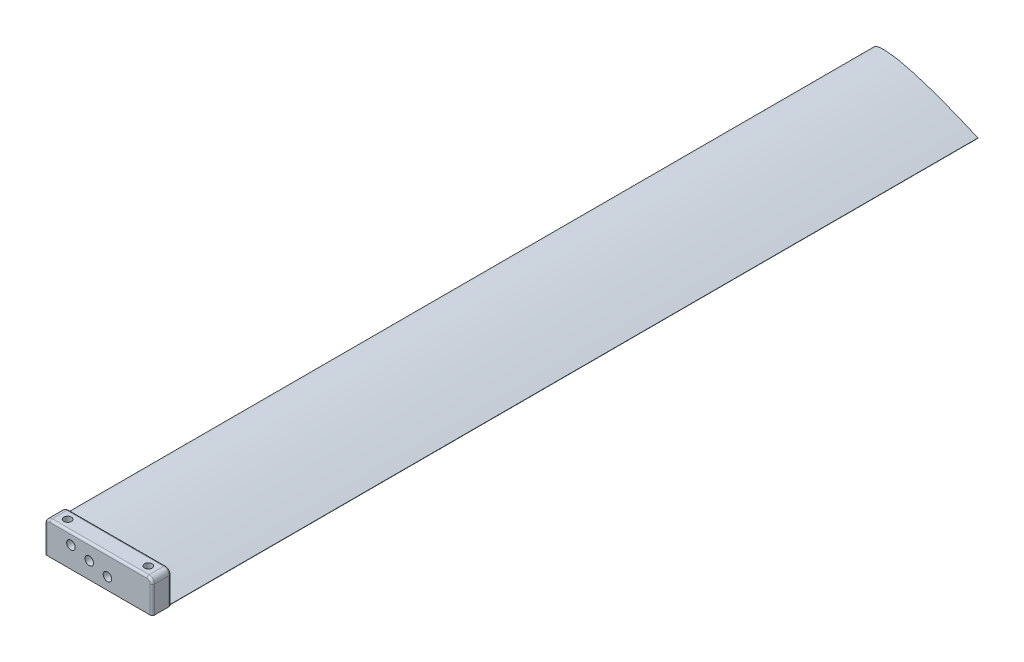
ISO-10303-21;
HEADER;
FILE_DESCRIPTION(('STEP AP214'),'2;1');
FILE_NAME('part.step','',(''),(''),'','','');
FILE_SCHEMA(('AUTOMOTIVE_DESIGN { 1 0 10303 214 1 1 1 1 }'));
ENDSEC;
DATA;
#1=APPLICATION_CONTEXT('core data for automotive mechanical design processes');
#2=APPLICATION_PROTOCOL_DEFINITION('international standard','automotive_design',2000,#1);
#3=PRODUCT_CONTEXT('',#1,'mechanical');
#4=PRODUCT('Part','Part','',(#3));
#5=PRODUCT_RELATED_PRODUCT_CATEGORY('part','',(#4));
#6=PRODUCT_DEFINITION_FORMATION('','',#4);
#7=PRODUCT_DEFINITION_CONTEXT('part definition',#1,'design');
#8=PRODUCT_DEFINITION('design','',#6,#7);
#9=PRODUCT_DEFINITION_SHAPE('','',#8);
#10=(LENGTH_UNIT() NAMED_UNIT(*) SI_UNIT(.MILLI.,.METRE.));
#11=(NAMED_UNIT(*) PLANE_ANGLE_UNIT() SI_UNIT($,.RADIAN.));
#12=(NAMED_UNIT(*) SI_UNIT($,.STERADIAN.) SOLID_ANGLE_UNIT());
#13=UNCERTAINTY_MEASURE_WITH_UNIT(LENGTH_MEASURE(1.E-05),#10,'distance_accuracy_value','');
#14=(GEOMETRIC_REPRESENTATION_CONTEXT(3) GLOBAL_UNCERTAINTY_ASSIGNED_CONTEXT((#13)) GLOBAL_UNIT_ASSIGNED_CONTEXT((#10,
#11,#12)) REPRESENTATION_CONTEXT('',''));
#15=CARTESIAN_POINT('',(0.,0.,0.));
#16=DIRECTION('',(0.,0.,1.));
#17=DIRECTION('',(1.,0.,0.));
#18=AXIS2_PLACEMENT_3D('',#15,#16,#17);
#19=CARTESIAN_POINT('',(6.13081109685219E-08,2.45893174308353E-07,0.));
#20=DIRECTION('',(0.,0.,-1.));
#21=DIRECTION('',(-1.,0.,0.));
#22=AXIS2_PLACEMENT_3D('',#19,#20,#21);
#23=PLANE('',#22);
#24=CARTESIAN_POINT('',(11.0904801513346,-2.76516726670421,0.));
#25=DIRECTION('',(0.,0.,-1.));
#26=DIRECTION('',(-1.,0.,0.));
#27=AXIS2_PLACEMENT_3D('',#24,#25,#26);
#28=CIRCLE('',#27,2.);
#29=CARTESIAN_POINT('',(9.09048015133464,-2.76516726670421,0.));
#30=VERTEX_POINT('',#29);
#31=EDGE_CURVE('E77',#30,#30,#28,.T.);
#32=ORIENTED_EDGE('',*,*,#31,.T.);
#33=EDGE_LOOP('',(#32));
#34=FACE_BOUND('',#33,.T.);
#35=CARTESIAN_POINT('',(19.7264687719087,-4.87509630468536,0.));
#36=DIRECTION('',(0.,0.,-1.));
#37=DIRECTION('',(-1.,0.,0.));
#38=AXIS2_PLACEMENT_3D('',#35,#36,#37);
#39=CIRCLE('',#38,2.00000000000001);
#40=CARTESIAN_POINT('',(17.7264687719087,-4.87509630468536,0.));
#41=VERTEX_POINT('',#40);
#42=EDGE_CURVE('E222',#41,#41,#39,.T.);
#43=ORIENTED_EDGE('',*,*,#42,.T.);
#44=EDGE_LOOP('',(#43));
#45=FACE_BOUND('',#44,.T.);
#46=CARTESIAN_POINT('',(28.3277194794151,-7.12244724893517,0.));
#47=DIRECTION('',(0.,0.,-1.));
#48=DIRECTION('',(-1.,0.,0.));
#49=AXIS2_PLACEMENT_3D('',#46,#47,#48);
#50=CIRCLE('',#49,2.);
#51=CARTESIAN_POINT('',(26.3277194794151,-7.12244724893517,0.));
#52=VERTEX_POINT('',#51);
#53=EDGE_CURVE('E215',#52,#52,#50,.T.);
#54=ORIENTED_EDGE('',*,*,#53,.T.);
#55=EDGE_LOOP('',(#54));
#56=FACE_BOUND('',#55,.T.);
#57=CARTESIAN_POINT('',(49.310441,-12.211752,0.));
#58=CARTESIAN_POINT('',(48.5244228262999,-11.8657049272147,0.));
#59=CARTESIAN_POINT('',(46.9535992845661,-11.174144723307,0.));
#60=CARTESIAN_POINT('',(43.8001058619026,-9.83033649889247,0.));
#61=CARTESIAN_POINT('',(39.8445837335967,-8.20403911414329,0.));
#62=CARTESIAN_POINT('',(35.0751396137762,-6.33296193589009,0.));
#63=CARTESIAN_POINT('',(30.2849545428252,-4.54710908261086,0.));
#64=CARTESIAN_POINT('',(25.4693502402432,-2.86297778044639,0.));
#65=CARTESIAN_POINT('',(20.620100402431,-1.31046332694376,0.));
#66=CARTESIAN_POINT('',(16.5368800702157,-0.171497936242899,0.));
#67=CARTESIAN_POINT('',(13.2377727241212,0.603440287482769,0.));
#68=CARTESIAN_POINT('',(10.7400649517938,1.09667848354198,0.));
#69=CARTESIAN_POINT('',(8.21087812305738,1.47806359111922,0.));
#70=CARTESIAN_POINT('',(6.07206028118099,1.66242657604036,0.));
#71=CARTESIAN_POINT('',(4.33195767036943,1.68140741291,0.));
#72=CARTESIAN_POINT('',(2.98703440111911,1.60069763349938,0.));
#73=CARTESIAN_POINT('',(1.81994498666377,1.38674481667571,0.));
#74=CARTESIAN_POINT('',(0.721860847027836,0.992369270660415,0.));
#75=CARTESIAN_POINT('',(-0.283483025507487,0.0706801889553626,0.));
#76=CARTESIAN_POINT('',(0.171475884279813,-1.21510315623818,0.));
#77=CARTESIAN_POINT('',(0.955878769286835,-2.07883507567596,0.));
#78=CARTESIAN_POINT('',(1.88591289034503,-2.81565928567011,0.));
#79=CARTESIAN_POINT('',(3.03551868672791,-3.51832584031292,0.));
#80=CARTESIAN_POINT('',(4.5808487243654,-4.31849594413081,0.));
#81=CARTESIAN_POINT('',(6.55586614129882,-5.15982667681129,0.));
#82=CARTESIAN_POINT('',(8.96805485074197,-6.01046482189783,0.));
#83=CARTESIAN_POINT('',(11.4049616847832,-6.74756371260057,0.));
#84=CARTESIAN_POINT('',(14.6817120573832,-7.61217067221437,0.));
#85=CARTESIAN_POINT('',(18.8216932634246,-8.52348088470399,0.));
#86=CARTESIAN_POINT('',(23.8321882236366,-9.42927632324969,0.));
#87=CARTESIAN_POINT('',(28.8747663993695,-10.2030649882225,0.));
#88=CARTESIAN_POINT('',(33.9426557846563,-10.8751074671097,0.));
#89=CARTESIAN_POINT('',(39.0322424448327,-11.4621609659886,0.));
#90=CARTESIAN_POINT('',(43.2882612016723,-11.883233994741,0.));
#91=CARTESIAN_POINT('',(46.7035103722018,-12.1771949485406,0.));
#92=CARTESIAN_POINT('',(48.4151330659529,-12.3040403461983,0.));
#93=CARTESIAN_POINT('',(49.271605,-12.367512,0.));
#94=B_SPLINE_CURVE_WITH_KNOTS('',3,(#57,#58,#59,#60,#61,#62,#63,#64,#65,#66,#67,#68,#69,#70,#71,
#72,#73,#74,#75,#76,#77,#78,#79,#80,#81,#82,#83,#84,#85,#86,#87,#88,#89,#90,#91,#92,#93),
.UNSPECIFIED.,.F.,.F.,(4,1,1,1,1,1,1,1,1,1,1,1,1,1,1,1,1,1,1,1,1,1,1,1,1,1,1,1,1,1,1,1,1,1,4),
(0.,0.0246840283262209,0.0493299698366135,0.0985220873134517,0.147602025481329,
0.196578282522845,0.245450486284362,0.294218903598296,0.342903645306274,0.367241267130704,
0.391607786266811,0.416059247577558,0.440726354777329,0.453242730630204,0.466028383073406,
0.479472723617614,0.486972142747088,0.500000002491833,0.513027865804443,0.52052727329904,
0.533971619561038,0.546757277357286,0.559273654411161,0.583940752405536,0.60839221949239,
0.632758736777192,0.657096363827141,0.70578110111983,0.754549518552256,0.803421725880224,
0.852397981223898,0.901477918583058,0.950670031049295,0.975315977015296,1.),.UNSPECIFIED.);
#95=CARTESIAN_POINT('',(49.310441,-12.211752,0.));
#96=VERTEX_POINT('',#95);
#97=CARTESIAN_POINT('',(49.271605,-12.367512,0.));
#98=VERTEX_POINT('',#97);
#99=EDGE_CURVE('E82',#96,#98,#94,.T.);
#100=ORIENTED_EDGE('',*,*,#99,.T.);
#101=CARTESIAN_POINT('',(49.291023,-12.289632,0.));
#102=DIRECTION('',(0.,0.,1.));
#103=DIRECTION('',(-1.,0.,0.));
#104=AXIS2_PLACEMENT_3D('',#101,#102,#103);
#105=CIRCLE('',#104,0.0802642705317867);
#106=EDGE_CURVE('E13',#98,#96,#105,.T.);
#107=ORIENTED_EDGE('',*,*,#106,.T.);
#108=EDGE_LOOP('',(#100,#107));
#109=FACE_BOUND('',#108,.T.);
#110=ADVANCED_FACE('F73',(#34,#45,#56,#109),#23,.F.);
#111=CARTESIAN_POINT('',(6.13081109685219E-08,2.45893174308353E-07,-381.));
#112=DIRECTION('',(0.,0.,-1.));
#113=DIRECTION('',(-1.,0.,0.));
#114=AXIS2_PLACEMENT_3D('',#111,#112,#113);
#115=PLANE('',#114);
#116=CARTESIAN_POINT('',(49.310441,-12.211752,-381.));
#117=CARTESIAN_POINT('',(48.5244228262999,-11.8657049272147,-381.));
#118=CARTESIAN_POINT('',(46.9535992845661,-11.174144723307,-381.));
#119=CARTESIAN_POINT('',(43.8001058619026,-9.83033649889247,-381.));
#120=CARTESIAN_POINT('',(39.8445837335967,-8.20403911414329,-381.));
#121=CARTESIAN_POINT('',(35.0751396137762,-6.33296193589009,-381.));
#122=CARTESIAN_POINT('',(30.2849545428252,-4.54710908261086,-381.));
#123=CARTESIAN_POINT('',(25.4693502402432,-2.86297778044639,-381.));
#124=CARTESIAN_POINT('',(20.620100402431,-1.31046332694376,-381.));
#125=CARTESIAN_POINT('',(16.5368800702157,-0.171497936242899,-381.));
#126=CARTESIAN_POINT('',(13.2377727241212,0.603440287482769,-381.));
#127=CARTESIAN_POINT('',(10.7400649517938,1.09667848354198,-381.));
#128=CARTESIAN_POINT('',(8.21087812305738,1.47806359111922,-381.));
#129=CARTESIAN_POINT('',(6.07206028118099,1.66242657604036,-381.));
#130=CARTESIAN_POINT('',(4.33195767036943,1.68140741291,-381.));
#131=CARTESIAN_POINT('',(2.98703440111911,1.60069763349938,-381.));
#132=CARTESIAN_POINT('',(1.81994498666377,1.38674481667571,-381.));
#133=CARTESIAN_POINT('',(0.721860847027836,0.992369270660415,-381.));
#134=CARTESIAN_POINT('',(-0.283483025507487,0.0706801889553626,-381.));
#135=CARTESIAN_POINT('',(0.171475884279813,-1.21510315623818,-381.));
#136=CARTESIAN_POINT('',(0.955878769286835,-2.07883507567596,-381.));
#137=CARTESIAN_POINT('',(1.88591289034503,-2.81565928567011,-381.));
#138=CARTESIAN_POINT('',(3.03551868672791,-3.51832584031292,-381.));
#139=CARTESIAN_POINT('',(4.5808487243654,-4.31849594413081,-381.));
#140=CARTESIAN_POINT('',(6.55586614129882,-5.15982667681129,-381.));
#141=CARTESIAN_POINT('',(8.96805485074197,-6.01046482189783,-381.));
#142=CARTESIAN_POINT('',(11.4049616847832,-6.74756371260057,-381.));
#143=CARTESIAN_POINT('',(14.6817120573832,-7.61217067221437,-381.));
#144=CARTESIAN_POINT('',(18.8216932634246,-8.52348088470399,-381.));
#145=CARTESIAN_POINT('',(23.8321882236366,-9.42927632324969,-381.));
#146=CARTESIAN_POINT('',(28.8747663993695,-10.2030649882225,-381.));
#147=CARTESIAN_POINT('',(33.9426557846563,-10.8751074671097,-381.));
#148=CARTESIAN_POINT('',(39.0322424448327,-11.4621609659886,-381.));
#149=CARTESIAN_POINT('',(43.2882612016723,-11.883233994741,-381.));
#150=CARTESIAN_POINT('',(46.7035103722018,-12.1771949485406,-381.));
#151=CARTESIAN_POINT('',(48.4151330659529,-12.3040403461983,-381.));
#152=CARTESIAN_POINT('',(49.271605,-12.367512,-381.));
#153=B_SPLINE_CURVE_WITH_KNOTS('',3,(#116,#117,#118,#119,#120,#121,#122,#123,#124,#125,#126,
#127,#128,#129,#130,#131,#132,#133,#134,#135,#136,#137,#138,#139,#140,#141,#142,#143,#144,#145,
#146,#147,#148,#149,#150,#151,#152),.UNSPECIFIED.,.F.,.F.,(4,1,1,1,1,1,1,1,1,1,1,1,1,1,1,1,1,1,
1,1,1,1,1,1,1,1,1,1,1,1,1,1,1,1,4),(0.,0.0246840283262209,0.0493299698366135,0.0985220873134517,
0.147602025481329,0.196578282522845,0.245450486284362,0.294218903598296,0.342903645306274,
0.367241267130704,0.391607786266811,0.416059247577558,0.440726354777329,0.453242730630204,
0.466028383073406,0.479472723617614,0.486972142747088,0.500000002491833,0.513027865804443,
0.52052727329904,0.533971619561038,0.546757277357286,0.559273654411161,0.583940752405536,
0.60839221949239,0.632758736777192,0.657096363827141,0.70578110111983,0.754549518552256,
0.803421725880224,0.852397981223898,0.901477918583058,0.950670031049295,0.975315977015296,1.),.UNSPECIFIED.);
#154=CARTESIAN_POINT('',(49.310441,-12.211752,-381.));
#155=VERTEX_POINT('',#154);
#156=CARTESIAN_POINT('',(49.271605,-12.367512,-381.));
#157=VERTEX_POINT('',#156);
#158=EDGE_CURVE('E106',#155,#157,#153,.T.);
#159=ORIENTED_EDGE('',*,*,#158,.F.);
#160=CARTESIAN_POINT('',(48.9107991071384,-12.194829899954,-381.));
#161=DIRECTION('',(0.,0.,1.));
#162=DIRECTION('',(-1.,0.,0.));
#163=AXIS2_PLACEMENT_3D('',#160,#161,#162);
#164=CIRCLE('',#163,0.399999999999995);
#165=EDGE_CURVE('E110',#157,#155,#164,.T.);
#166=ORIENTED_EDGE('',*,*,#165,.F.);
#167=EDGE_LOOP('',(#159,#166));
#168=FACE_BOUND('',#167,.T.);
#169=ADVANCED_FACE('F120',(#168),#115,.T.);
#170=CARTESIAN_POINT('',(49.310441,-12.211752,-381.));
#171=CARTESIAN_POINT('',(49.310441,-12.211752,0.));
#172=CARTESIAN_POINT('',(48.5244228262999,-11.8657049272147,-381.));
#173=CARTESIAN_POINT('',(48.5244228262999,-11.8657049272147,0.));
#174=CARTESIAN_POINT('',(46.9535992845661,-11.174144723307,-381.));
#175=CARTESIAN_POINT('',(46.9535992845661,-11.174144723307,0.));
#176=CARTESIAN_POINT('',(43.8001058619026,-9.83033649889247,-381.));
#177=CARTESIAN_POINT('',(43.8001058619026,-9.83033649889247,0.));
#178=CARTESIAN_POINT('',(39.8445837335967,-8.20403911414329,-381.));
#179=CARTESIAN_POINT('',(39.8445837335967,-8.20403911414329,0.));
#180=CARTESIAN_POINT('',(35.0751396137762,-6.33296193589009,-381.));
#181=CARTESIAN_POINT('',(35.0751396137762,-6.33296193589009,0.));
#182=CARTESIAN_POINT('',(30.2849545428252,-4.54710908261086,-381.));
#183=CARTESIAN_POINT('',(30.2849545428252,-4.54710908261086,0.));
#184=CARTESIAN_POINT('',(25.4693502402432,-2.86297778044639,-381.));
#185=CARTESIAN_POINT('',(25.4693502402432,-2.86297778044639,0.));
#186=CARTESIAN_POINT('',(20.620100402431,-1.31046332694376,-381.));
#187=CARTESIAN_POINT('',(20.620100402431,-1.31046332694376,0.));
#188=CARTESIAN_POINT('',(16.5368800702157,-0.171497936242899,-381.));
#189=CARTESIAN_POINT('',(16.5368800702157,-0.171497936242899,0.));
#190=CARTESIAN_POINT('',(13.2377727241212,0.603440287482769,-381.));
#191=CARTESIAN_POINT('',(13.2377727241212,0.603440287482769,0.));
#192=CARTESIAN_POINT('',(10.7400649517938,1.09667848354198,-381.));
#193=CARTESIAN_POINT('',(10.7400649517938,1.09667848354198,0.));
#194=CARTESIAN_POINT('',(8.21087812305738,1.47806359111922,-381.));
#195=CARTESIAN_POINT('',(8.21087812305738,1.47806359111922,0.));
#196=CARTESIAN_POINT('',(6.07206028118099,1.66242657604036,-381.));
#197=CARTESIAN_POINT('',(6.07206028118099,1.66242657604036,0.));
#198=CARTESIAN_POINT('',(4.33195767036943,1.68140741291,-381.));
#199=CARTESIAN_POINT('',(4.33195767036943,1.68140741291,0.));
#200=CARTESIAN_POINT('',(2.98703440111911,1.60069763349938,-381.));
#201=CARTESIAN_POINT('',(2.98703440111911,1.60069763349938,0.));
#202=CARTESIAN_POINT('',(1.81994498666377,1.38674481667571,-381.));
#203=CARTESIAN_POINT('',(1.81994498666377,1.38674481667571,0.));
#204=CARTESIAN_POINT('',(0.721860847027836,0.992369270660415,-381.));
#205=CARTESIAN_POINT('',(0.721860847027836,0.992369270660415,0.));
#206=CARTESIAN_POINT('',(-0.283483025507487,0.0706801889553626,-381.));
#207=CARTESIAN_POINT('',(-0.283483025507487,0.0706801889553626,0.));
#208=CARTESIAN_POINT('',(0.171475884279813,-1.21510315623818,-381.));
#209=CARTESIAN_POINT('',(0.171475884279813,-1.21510315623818,0.));
#210=CARTESIAN_POINT('',(0.955878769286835,-2.07883507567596,-381.));
#211=CARTESIAN_POINT('',(0.955878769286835,-2.07883507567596,0.));
#212=CARTESIAN_POINT('',(1.88591289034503,-2.81565928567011,-381.));
#213=CARTESIAN_POINT('',(1.88591289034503,-2.81565928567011,0.));
#214=CARTESIAN_POINT('',(3.03551868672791,-3.51832584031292,-381.));
#215=CARTESIAN_POINT('',(3.03551868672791,-3.51832584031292,0.));
#216=CARTESIAN_POINT('',(4.5808487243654,-4.31849594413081,-381.));
#217=CARTESIAN_POINT('',(4.5808487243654,-4.31849594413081,0.));
#218=CARTESIAN_POINT('',(6.55586614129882,-5.15982667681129,-381.));
#219=CARTESIAN_POINT('',(6.55586614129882,-5.15982667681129,0.));
#220=CARTESIAN_POINT('',(8.96805485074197,-6.01046482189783,-381.));
#221=CARTESIAN_POINT('',(8.96805485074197,-6.01046482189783,0.));
#222=CARTESIAN_POINT('',(11.4049616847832,-6.74756371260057,-381.));
#223=CARTESIAN_POINT('',(11.4049616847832,-6.74756371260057,0.));
#224=CARTESIAN_POINT('',(14.6817120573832,-7.61217067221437,-381.));
#225=CARTESIAN_POINT('',(14.6817120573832,-7.61217067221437,0.));
#226=CARTESIAN_POINT('',(18.8216932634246,-8.52348088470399,-381.));
#227=CARTESIAN_POINT('',(18.8216932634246,-8.52348088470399,0.));
#228=CARTESIAN_POINT('',(23.8321882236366,-9.42927632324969,-381.));
#229=CARTESIAN_POINT('',(23.8321882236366,-9.42927632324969,0.));
#230=CARTESIAN_POINT('',(28.8747663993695,-10.2030649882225,-381.));
#231=CARTESIAN_POINT('',(28.8747663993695,-10.2030649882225,0.));
#232=CARTESIAN_POINT('',(33.9426557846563,-10.8751074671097,-381.));
#233=CARTESIAN_POINT('',(33.9426557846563,-10.8751074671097,0.));
#234=CARTESIAN_POINT('',(39.0322424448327,-11.4621609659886,-381.));
#235=CARTESIAN_POINT('',(39.0322424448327,-11.4621609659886,0.));
#236=CARTESIAN_POINT('',(43.2882612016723,-11.883233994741,-381.));
#237=CARTESIAN_POINT('',(43.2882612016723,-11.883233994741,0.));
#238=CARTESIAN_POINT('',(46.7035103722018,-12.1771949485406,-381.));
#239=CARTESIAN_POINT('',(46.7035103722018,-12.1771949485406,0.));
#240=CARTESIAN_POINT('',(48.4151330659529,-12.3040403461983,-381.));
#241=CARTESIAN_POINT('',(48.4151330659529,-12.3040403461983,0.));
#242=CARTESIAN_POINT('',(49.271605,-12.367512,-381.));
#243=CARTESIAN_POINT('',(49.271605,-12.367512,0.));
#244=B_SPLINE_SURFACE_WITH_KNOTS('',3,1,((#170,#171),(#172,#173),(#174,#175),(#176,#177),(#178,
#179),(#180,#181),(#182,#183),(#184,#185),(#186,#187),(#188,#189),(#190,#191),(#192,#193),(#194,
#195),(#196,#197),(#198,#199),(#200,#201),(#202,#203),(#204,#205),(#206,#207),(#208,#209),(#210,
#211),(#212,#213),(#214,#215),(#216,#217),(#218,#219),(#220,#221),(#222,#223),(#224,#225),(#226,
#227),(#228,#229),(#230,#231),(#232,#233),(#234,#235),(#236,#237),(#238,#239),(#240,#241),(#242,
#243)),.UNSPECIFIED.,.F.,.F.,.F.,(4,1,1,1,1,1,1,1,1,1,1,1,1,1,1,1,1,1,1,1,1,1,1,1,1,1,1,1,1,1,1,
1,1,1,4),(2,2),(0.,0.0246840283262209,0.0493299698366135,0.0985220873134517,0.147602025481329,
0.196578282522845,0.245450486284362,0.294218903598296,0.342903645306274,0.367241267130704,
0.391607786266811,0.416059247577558,0.440726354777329,0.453242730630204,0.466028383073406,
0.479472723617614,0.486972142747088,0.500000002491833,0.513027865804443,0.52052727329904,
0.533971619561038,0.546757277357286,0.559273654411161,0.583940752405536,0.60839221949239,
0.632758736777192,0.657096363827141,0.70578110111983,0.754549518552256,0.803421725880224,
0.852397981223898,0.901477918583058,0.950670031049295,0.975315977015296,1.),(0.,1.),.UNSPECIFIED.);
#245=DIRECTION('',(0.,0.,1.));
#246=VECTOR('',#245,1.);
#247=CARTESIAN_POINT('',(49.271605,-12.367512,-190.5));
#248=LINE('',#247,#246);
#249=EDGE_CURVE('E90',#157,#98,#248,.T.);
#250=DIRECTION('',(0.,0.,-1.));
#251=VECTOR('',#250,1.);
#252=CARTESIAN_POINT('',(49.310441,-12.211752,-190.5));
#253=LINE('',#252,#251);
#254=EDGE_CURVE('E102',#96,#155,#253,.T.);
#255=ORIENTED_EDGE('',*,*,#158,.T.);
#256=ORIENTED_EDGE('',*,*,#249,.T.);
#257=ORIENTED_EDGE('',*,*,#99,.F.);
#258=ORIENTED_EDGE('',*,*,#254,.T.);
#259=EDGE_LOOP('',(#255,#256,#257,#258));
#260=FACE_BOUND('',#259,.T.);
#261=ADVANCED_FACE('F104',(#260),#244,.T.);
#262=CARTESIAN_POINT('',(49.271605,-12.367512,-381.));
#263=CARTESIAN_POINT('',(49.271605,-12.367512,0.));
#264=CARTESIAN_POINT('',(49.2773800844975,-12.3554454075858,-381.));
#265=CARTESIAN_POINT('',(49.284585,-12.3707483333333,0.));
#266=CARTESIAN_POINT('',(49.2825533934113,-12.3430184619,-381.));
#267=CARTESIAN_POINT('',(49.30249532,-12.3719050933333,0.));
#268=CARTESIAN_POINT('',(49.2916470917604,-12.3176418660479,-381.));
#269=CARTESIAN_POINT('',(49.34193788,-12.3552685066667,0.));
#270=CARTESIAN_POINT('',(49.2955674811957,-12.3046922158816,-381.));
#271=CARTESIAN_POINT('',(49.3624303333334,-12.33501,0.));
#272=CARTESIAN_POINT('',(49.3021059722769,-12.2784682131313,-381.));
#273=CARTESIAN_POINT('',(49.3753756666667,-12.28309,0.));
#274=CARTESIAN_POINT('',(49.3047240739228,-12.2651938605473,-381.));
#275=CARTESIAN_POINT('',(49.36679292,-12.2555821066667,0.));
#276=CARTESIAN_POINT('',(49.3086086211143,-12.2385184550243,-381.));
#277=CARTESIAN_POINT('',(49.33977788,-12.2223754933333,0.));
#278=CARTESIAN_POINT('',(49.30987506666,-12.2251174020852,-381.));
#279=CARTESIAN_POINT('',(49.323421,-12.2149883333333,0.));
#280=CARTESIAN_POINT('',(49.310441,-12.211752,-381.));
#281=CARTESIAN_POINT('',(49.310441,-12.211752,0.));
#282=B_SPLINE_SURFACE_WITH_KNOTS('',3,1,((#262,#263),(#264,#265),(#266,#267),(#268,#269),(#270,
#271),(#272,#273),(#274,#275),(#276,#277),(#278,#279),(#280,#281)),.UNSPECIFIED.,.F.,.F.,.F.,(4,
2,2,2,4),(2,2),(0.,0.25,0.5,0.75,1.),(0.,1.),.UNSPECIFIED.);
#283=ORIENTED_EDGE('',*,*,#165,.T.);
#284=ORIENTED_EDGE('',*,*,#254,.F.);
#285=ORIENTED_EDGE('',*,*,#106,.F.);
#286=ORIENTED_EDGE('',*,*,#249,.F.);
#287=EDGE_LOOP('',(#283,#284,#285,#286));
#288=FACE_BOUND('',#287,.T.);
#289=ADVANCED_FACE('F113',(#288),#282,.T.);
#290=CARTESIAN_POINT('',(28.3277194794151,-7.12244724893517,-35.56));
#291=DIRECTION('',(0.,0.,1.));
#292=DIRECTION('',(1.,0.,0.));
#293=AXIS2_PLACEMENT_3D('',#290,#291,#292);
#294=CYLINDRICAL_SURFACE('',#293,2.);
#295=CARTESIAN_POINT('',(28.3277194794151,-7.12244724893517,-35.56));
#296=DIRECTION('',(0.,0.,1.));
#297=DIRECTION('',(1.,0.,0.));
#298=AXIS2_PLACEMENT_3D('',#295,#296,#297);
#299=CIRCLE('',#298,2.);
#300=CARTESIAN_POINT('',(30.3277194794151,-7.12244724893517,-35.56));
#301=VERTEX_POINT('',#300);
#302=EDGE_CURVE('E338',#301,#301,#299,.T.);
#303=ORIENTED_EDGE('',*,*,#302,.F.);
#304=EDGE_LOOP('',(#303));
#305=FACE_BOUND('',#304,.T.);
#306=ORIENTED_EDGE('',*,*,#53,.F.);
#307=EDGE_LOOP('',(#306));
#308=FACE_BOUND('',#307,.T.);
#309=ADVANCED_FACE('F182',(#305,#308),#294,.F.);
#310=CARTESIAN_POINT('',(28.3277194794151,-7.12244724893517,-35.56));
#311=DIRECTION('',(0.,0.,1.));
#312=DIRECTION('',(1.,0.,0.));
#313=AXIS2_PLACEMENT_3D('',#310,#311,#312);
#314=PLANE('',#313);
#315=ORIENTED_EDGE('',*,*,#302,.T.);
#316=EDGE_LOOP('',(#315));
#317=FACE_BOUND('',#316,.T.);
#318=ADVANCED_FACE('F139',(#317),#314,.T.);
#319=CARTESIAN_POINT('',(19.7264687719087,-4.87509630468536,-35.56));
#320=DIRECTION('',(0.,0.,1.));
#321=DIRECTION('',(1.,0.,0.));
#322=AXIS2_PLACEMENT_3D('',#319,#320,#321);
#323=CYLINDRICAL_SURFACE('',#322,2.00000000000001);
#324=CARTESIAN_POINT('',(19.7264687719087,-4.87509630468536,-35.56));
#325=DIRECTION('',(0.,0.,1.));
#326=DIRECTION('',(1.,0.,0.));
#327=AXIS2_PLACEMENT_3D('',#324,#325,#326);
#328=CIRCLE('',#327,2.00000000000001);
#329=CARTESIAN_POINT('',(21.7264687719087,-4.87509630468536,-35.56));
#330=VERTEX_POINT('',#329);
#331=EDGE_CURVE('E337',#330,#330,#328,.T.);
#332=ORIENTED_EDGE('',*,*,#331,.F.);
#333=EDGE_LOOP('',(#332));
#334=FACE_BOUND('',#333,.T.);
#335=ORIENTED_EDGE('',*,*,#42,.F.);
#336=EDGE_LOOP('',(#335));
#337=FACE_BOUND('',#336,.T.);
#338=ADVANCED_FACE('F243',(#334,#337),#323,.F.);
#339=CARTESIAN_POINT('',(19.7264687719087,-4.87509630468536,-35.56));
#340=DIRECTION('',(0.,0.,1.));
#341=DIRECTION('',(1.,0.,0.));
#342=AXIS2_PLACEMENT_3D('',#339,#340,#341);
#343=PLANE('',#342);
#344=ORIENTED_EDGE('',*,*,#331,.T.);
#345=EDGE_LOOP('',(#344));
#346=FACE_BOUND('',#345,.T.);
#347=ADVANCED_FACE('F234',(#346),#343,.T.);
#348=CARTESIAN_POINT('',(11.0904801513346,-2.76516726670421,-35.56));
#349=DIRECTION('',(0.,0.,1.));
#350=DIRECTION('',(1.,0.,0.));
#351=AXIS2_PLACEMENT_3D('',#348,#349,#350);
#352=CYLINDRICAL_SURFACE('',#351,2.);
#353=CARTESIAN_POINT('',(11.0904801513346,-2.76516726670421,-35.56));
#354=DIRECTION('',(0.,0.,1.));
#355=DIRECTION('',(1.,0.,0.));
#356=AXIS2_PLACEMENT_3D('',#353,#354,#355);
#357=CIRCLE('',#356,2.);
#358=CARTESIAN_POINT('',(13.0904801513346,-2.76516726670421,-35.56));
#359=VERTEX_POINT('',#358);
#360=EDGE_CURVE('E223',#359,#359,#357,.T.);
#361=ORIENTED_EDGE('',*,*,#360,.F.);
#362=EDGE_LOOP('',(#361));
#363=FACE_BOUND('',#362,.T.);
#364=ORIENTED_EDGE('',*,*,#31,.F.);
#365=EDGE_LOOP('',(#364));
#366=FACE_BOUND('',#365,.T.);
#367=ADVANCED_FACE('F231',(#363,#366),#352,.F.);
#368=CARTESIAN_POINT('',(11.0904801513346,-2.76516726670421,-35.56));
#369=DIRECTION('',(0.,0.,1.));
#370=DIRECTION('',(1.,0.,0.));
#371=AXIS2_PLACEMENT_3D('',#368,#369,#370);
#372=PLANE('',#371);
#373=ORIENTED_EDGE('',*,*,#360,.T.);
#374=EDGE_LOOP('',(#373));
#375=FACE_BOUND('',#374,.T.);
#376=ADVANCED_FACE('F233',(#375),#372,.T.);
#377=CLOSED_SHELL('',(#110,#169,#261,#289,#309,#318,#338,#347,#367,#376));
#378=MANIFOLD_SOLID_BREP('B2',#377);
#379=CARTESIAN_POINT('',(-1.27,2.54,8.89));
#380=DIRECTION('',(1.,0.,0.));
#381=DIRECTION('',(0.,1.,0.));
#382=AXIS2_PLACEMENT_3D('',#379,#380,#381);
#383=PLANE('',#382);
#384=DIRECTION('',(0.,0.,-1.));
#385=VECTOR('',#384,1.);
#386=CARTESIAN_POINT('',(-1.27,0.,0.));
#387=LINE('',#386,#385);
#388=CARTESIAN_POINT('',(-1.27,0.,7.874));
#389=VERTEX_POINT('',#388);
#390=CARTESIAN_POINT('',(-1.27,0.,1.016));
#391=VERTEX_POINT('',#390);
#392=EDGE_CURVE('E465',#389,#391,#387,.T.);
#393=ORIENTED_EDGE('',*,*,#392,.T.);
#394=DIRECTION('',(0.,-1.,0.));
#395=VECTOR('',#394,1.);
#396=CARTESIAN_POINT('',(-1.27,2.54,1.016));
#397=LINE('',#396,#395);
#398=CARTESIAN_POINT('',(-1.27,-12.7,1.016));
#399=VERTEX_POINT('',#398);
#400=EDGE_CURVE('E471',#391,#399,#397,.T.);
#401=ORIENTED_EDGE('',*,*,#400,.T.);
#402=DIRECTION('',(0.,0.,-1.));
#403=VECTOR('',#402,1.);
#404=CARTESIAN_POINT('',(-1.27,-12.7,8.89));
#405=LINE('',#404,#403);
#406=CARTESIAN_POINT('',(-1.27,-12.7,7.874));
#407=VERTEX_POINT('',#406);
#408=EDGE_CURVE('E468',#407,#399,#405,.T.);
#409=ORIENTED_EDGE('',*,*,#408,.F.);
#410=DIRECTION('',(0.,-1.,0.));
#411=VECTOR('',#410,1.);
#412=CARTESIAN_POINT('',(-1.27,0.,7.874));
#413=LINE('',#412,#411);
#414=EDGE_CURVE('E462',#407,#389,#413,.F.);
#415=ORIENTED_EDGE('',*,*,#414,.T.);
#416=EDGE_LOOP('',(#393,#401,#409,#415));
#417=FACE_BOUND('',#416,.T.);
#418=ADVANCED_FACE('F371',(#417),#383,.F.);
#419=CARTESIAN_POINT('',(-1.27,-12.7,8.89));
#420=DIRECTION('',(0.,1.,0.));
#421=DIRECTION('',(0.,0.,1.));
#422=AXIS2_PLACEMENT_3D('',#419,#420,#421);
#423=PLANE('',#422);
#424=CARTESIAN_POINT('',(43.18,-12.7,4.445));
#425=DIRECTION('',(0.,1.,0.));
#426=DIRECTION('',(0.,0.,1.));
#427=AXIS2_PLACEMENT_3D('',#424,#425,#426);
#428=CIRCLE('',#427,1.7907);
#429=CARTESIAN_POINT('',(43.18,-12.7,6.2357));
#430=VERTEX_POINT('',#429);
#431=EDGE_CURVE('E541',#430,#430,#428,.T.);
#432=ORIENTED_EDGE('',*,*,#431,.T.);
#433=EDGE_LOOP('',(#432));
#434=FACE_BOUND('',#433,.T.);
#435=CARTESIAN_POINT('',(5.08,-12.7,4.445));
#436=DIRECTION('',(0.,1.,0.));
#437=DIRECTION('',(0.,0.,1.));
#438=AXIS2_PLACEMENT_3D('',#435,#436,#437);
#439=CIRCLE('',#438,1.7907);
#440=CARTESIAN_POINT('',(5.08,-12.7,6.2357));
#441=VERTEX_POINT('',#440);
#442=EDGE_CURVE('E548',#441,#441,#439,.T.);
#443=ORIENTED_EDGE('',*,*,#442,.T.);
#444=EDGE_LOOP('',(#443));
#445=FACE_BOUND('',#444,.T.);
#446=ORIENTED_EDGE('',*,*,#408,.T.);
#447=CARTESIAN_POINT('',(-0.253999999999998,-12.7,1.016));
#448=DIRECTION('',(0.,1.,0.));
#449=DIRECTION('',(0.,0.,1.));
#450=AXIS2_PLACEMENT_3D('',#447,#448,#449);
#451=CIRCLE('',#450,1.016);
#452=CARTESIAN_POINT('',(-0.253999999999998,-12.7,0.));
#453=VERTEX_POINT('',#452);
#454=EDGE_CURVE('E585',#399,#453,#451,.F.);
#455=ORIENTED_EDGE('',*,*,#454,.T.);
#456=DIRECTION('',(1.,0.,0.));
#457=VECTOR('',#456,1.);
#458=CARTESIAN_POINT('',(-1.27,-12.7,0.));
#459=LINE('',#458,#457);
#460=CARTESIAN_POINT('',(48.514,-12.7,0.));
#461=VERTEX_POINT('',#460);
#462=EDGE_CURVE('E544',#453,#461,#459,.T.);
#463=ORIENTED_EDGE('',*,*,#462,.T.);
#464=CARTESIAN_POINT('',(48.514,-12.7,1.016));
#465=DIRECTION('',(0.,1.,0.));
#466=DIRECTION('',(0.,0.,1.));
#467=AXIS2_PLACEMENT_3D('',#464,#465,#466);
#468=CIRCLE('',#467,1.016);
#469=CARTESIAN_POINT('',(49.53,-12.7,1.016));
#470=VERTEX_POINT('',#469);
#471=EDGE_CURVE('E581',#461,#470,#468,.F.);
#472=ORIENTED_EDGE('',*,*,#471,.T.);
#473=DIRECTION('',(0.,0.,-1.));
#474=VECTOR('',#473,1.);
#475=CARTESIAN_POINT('',(49.53,-12.7,8.89));
#476=LINE('',#475,#474);
#477=CARTESIAN_POINT('',(49.53,-12.7,7.874));
#478=VERTEX_POINT('',#477);
#479=EDGE_CURVE('E558',#478,#470,#476,.T.);
#480=ORIENTED_EDGE('',*,*,#479,.F.);
#481=CARTESIAN_POINT('',(48.514,-12.7,7.874));
#482=DIRECTION('',(0.,1.,0.));
#483=DIRECTION('',(0.,0.,1.));
#484=AXIS2_PLACEMENT_3D('',#481,#482,#483);
#485=CIRCLE('',#484,1.016);
#486=CARTESIAN_POINT('',(48.514,-12.7,8.89));
#487=VERTEX_POINT('',#486);
#488=EDGE_CURVE('E579',#478,#487,#485,.F.);
#489=ORIENTED_EDGE('',*,*,#488,.T.);
#490=DIRECTION('',(1.,0.,0.));
#491=VECTOR('',#490,1.);
#492=CARTESIAN_POINT('',(-1.27,-12.7,8.89));
#493=LINE('',#492,#491);
#494=CARTESIAN_POINT('',(-0.253999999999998,-12.7,8.89));
#495=VERTEX_POINT('',#494);
#496=EDGE_CURVE('E555',#495,#487,#493,.T.);
#497=ORIENTED_EDGE('',*,*,#496,.F.);
#498=CARTESIAN_POINT('',(-0.253999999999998,-12.7,7.874));
#499=DIRECTION('',(0.,1.,0.));
#500=DIRECTION('',(0.,0.,1.));
#501=AXIS2_PLACEMENT_3D('',#498,#499,#500);
#502=CIRCLE('',#501,1.016);
#503=EDGE_CURVE('E583',#495,#407,#502,.F.);
#504=ORIENTED_EDGE('',*,*,#503,.T.);
#505=EDGE_LOOP('',(#446,#455,#463,#472,#480,#489,#497,#504));
#506=FACE_BOUND('',#505,.T.);
#507=ADVANCED_FACE('F620',(#434,#445,#506),#423,.F.);
#508=CARTESIAN_POINT('',(49.53,2.54,8.89));
#509=DIRECTION('',(1.,0.,0.));
#510=DIRECTION('',(0.,0.,-1.));
#511=AXIS2_PLACEMENT_3D('',#508,#509,#510);
#512=PLANE('',#511);
#513=ORIENTED_EDGE('',*,*,#479,.T.);
#514=DIRECTION('',(0.,-1.,0.));
#515=VECTOR('',#514,1.);
#516=CARTESIAN_POINT('',(49.53,0.,1.016));
#517=LINE('',#516,#515);
#518=CARTESIAN_POINT('',(49.53,0.,1.016));
#519=VERTEX_POINT('',#518);
#520=EDGE_CURVE('E71',#470,#519,#517,.F.);
#521=ORIENTED_EDGE('',*,*,#520,.T.);
#522=DIRECTION('',(0.,0.,-1.));
#523=VECTOR('',#522,1.);
#524=CARTESIAN_POINT('',(49.53,0.,8.89));
#525=LINE('',#524,#523);
#526=CARTESIAN_POINT('',(49.53,0.,7.874));
#527=VERTEX_POINT('',#526);
#528=EDGE_CURVE('E472',#519,#527,#525,.F.);
#529=ORIENTED_EDGE('',*,*,#528,.T.);
#530=DIRECTION('',(0.,-1.,0.));
#531=VECTOR('',#530,1.);
#532=CARTESIAN_POINT('',(49.53,2.54,7.874));
#533=LINE('',#532,#531);
#534=EDGE_CURVE('E380',#527,#478,#533,.T.);
#535=ORIENTED_EDGE('',*,*,#534,.T.);
#536=EDGE_LOOP('',(#513,#521,#529,#535));
#537=FACE_BOUND('',#536,.T.);
#538=ADVANCED_FACE('F614',(#537),#512,.T.);
#539=CARTESIAN_POINT('',(-1.27,2.54,8.89));
#540=DIRECTION('',(0.,1.,0.));
#541=DIRECTION('',(0.,0.,1.));
#542=AXIS2_PLACEMENT_3D('',#539,#540,#541);
#543=PLANE('',#542);
#544=CARTESIAN_POINT('',(43.18,2.54,4.445));
#545=DIRECTION('',(0.,1.,0.));
#546=DIRECTION('',(0.,0.,1.));
#547=AXIS2_PLACEMENT_3D('',#544,#545,#546);
#548=CIRCLE('',#547,1.7907);
#549=CARTESIAN_POINT('',(43.18,2.54,6.2357));
#550=VERTEX_POINT('',#549);
#551=EDGE_CURVE('E545',#550,#550,#548,.T.);
#552=ORIENTED_EDGE('',*,*,#551,.F.);
#553=EDGE_LOOP('',(#552));
#554=FACE_BOUND('',#553,.T.);
#555=CARTESIAN_POINT('',(5.08,2.54,4.445));
#556=DIRECTION('',(0.,1.,0.));
#557=DIRECTION('',(0.,0.,1.));
#558=AXIS2_PLACEMENT_3D('',#555,#556,#557);
#559=CIRCLE('',#558,1.7907);
#560=CARTESIAN_POINT('',(5.08,2.54,6.2357));
#561=VERTEX_POINT('',#560);
#562=EDGE_CURVE('E551',#561,#561,#559,.T.);
#563=ORIENTED_EDGE('',*,*,#562,.F.);
#564=EDGE_LOOP('',(#563));
#565=FACE_BOUND('',#564,.T.);
#566=DIRECTION('',(0.,0.,-1.));
#567=VECTOR('',#566,1.);
#568=CARTESIAN_POINT('',(46.99,2.54,8.89));
#569=LINE('',#568,#567);
#570=CARTESIAN_POINT('',(46.99,2.54,7.874));
#571=VERTEX_POINT('',#570);
#572=CARTESIAN_POINT('',(46.99,2.54,1.016));
#573=VERTEX_POINT('',#572);
#574=EDGE_CURVE('E482',#571,#573,#569,.T.);
#575=ORIENTED_EDGE('',*,*,#574,.T.);
#576=DIRECTION('',(1.,0.,0.));
#577=VECTOR('',#576,1.);
#578=CARTESIAN_POINT('',(1.27,2.54,1.016));
#579=LINE('',#578,#577);
#580=CARTESIAN_POINT('',(1.27,2.54,1.016));
#581=VERTEX_POINT('',#580);
#582=EDGE_CURVE('E599',#573,#581,#579,.F.);
#583=ORIENTED_EDGE('',*,*,#582,.T.);
#584=DIRECTION('',(0.,0.,-1.));
#585=VECTOR('',#584,1.);
#586=CARTESIAN_POINT('',(1.27,2.54,8.89));
#587=LINE('',#586,#585);
#588=CARTESIAN_POINT('',(1.27,2.54,7.874));
#589=VERTEX_POINT('',#588);
#590=EDGE_CURVE('E574',#581,#589,#587,.F.);
#591=ORIENTED_EDGE('',*,*,#590,.T.);
#592=DIRECTION('',(1.,0.,0.));
#593=VECTOR('',#592,1.);
#594=CARTESIAN_POINT('',(-1.27,2.54,7.874));
#595=LINE('',#594,#593);
#596=EDGE_CURVE('E597',#589,#571,#595,.T.);
#597=ORIENTED_EDGE('',*,*,#596,.T.);
#598=EDGE_LOOP('',(#575,#583,#591,#597));
#599=FACE_BOUND('',#598,.T.);
#600=ADVANCED_FACE('F667',(#554,#565,#599),#543,.T.);
#601=CARTESIAN_POINT('',(0.,0.,8.89));
#602=DIRECTION('',(0.,0.,1.));
#603=DIRECTION('',(1.,0.,0.));
#604=AXIS2_PLACEMENT_3D('',#601,#602,#603);
#605=PLANE('',#604);
#606=CARTESIAN_POINT('',(11.0904801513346,-2.76516726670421,8.89));
#607=DIRECTION('',(0.,0.,1.));
#608=DIRECTION('',(1.,0.,0.));
#609=AXIS2_PLACEMENT_3D('',#606,#607,#608);
#610=CIRCLE('',#609,2.);
#611=CARTESIAN_POINT('',(13.0904801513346,-2.76516726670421,8.89));
#612=VERTEX_POINT('',#611);
#613=EDGE_CURVE('E537',#612,#612,#610,.T.);
#614=ORIENTED_EDGE('',*,*,#613,.F.);
#615=EDGE_LOOP('',(#614));
#616=FACE_BOUND('',#615,.T.);
#617=CARTESIAN_POINT('',(19.7264687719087,-4.87509630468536,8.89));
#618=DIRECTION('',(0.,0.,1.));
#619=DIRECTION('',(1.,0.,0.));
#620=AXIS2_PLACEMENT_3D('',#617,#618,#619);
#621=CIRCLE('',#620,2.00000000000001);
#622=CARTESIAN_POINT('',(21.7264687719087,-4.87509630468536,8.89));
#623=VERTEX_POINT('',#622);
#624=EDGE_CURVE('E532',#623,#623,#621,.T.);
#625=ORIENTED_EDGE('',*,*,#624,.F.);
#626=EDGE_LOOP('',(#625));
#627=FACE_BOUND('',#626,.T.);
#628=CARTESIAN_POINT('',(28.3277194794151,-7.12244724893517,8.89));
#629=DIRECTION('',(0.,0.,1.));
#630=DIRECTION('',(1.,0.,0.));
#631=AXIS2_PLACEMENT_3D('',#628,#629,#630);
#632=CIRCLE('',#631,2.);
#633=CARTESIAN_POINT('',(30.3277194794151,-7.12244724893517,8.89));
#634=VERTEX_POINT('',#633);
#635=EDGE_CURVE('E526',#634,#634,#632,.T.);
#636=ORIENTED_EDGE('',*,*,#635,.F.);
#637=EDGE_LOOP('',(#636));
#638=FACE_BOUND('',#637,.T.);
#639=CARTESIAN_POINT('',(1.27,0.,8.89));
#640=DIRECTION('',(0.,0.,1.));
#641=DIRECTION('',(1.,0.,0.));
#642=AXIS2_PLACEMENT_3D('',#639,#640,#641);
#643=CIRCLE('',#642,1.524);
#644=CARTESIAN_POINT('',(1.27,1.524,8.89));
#645=VERTEX_POINT('',#644);
#646=CARTESIAN_POINT('',(-0.254,0.,8.89));
#647=VERTEX_POINT('',#646);
#648=EDGE_CURVE('E388',#645,#647,#643,.T.);
#649=ORIENTED_EDGE('',*,*,#648,.T.);
#650=DIRECTION('',(0.,-1.,0.));
#651=VECTOR('',#650,1.);
#652=CARTESIAN_POINT('',(-0.253999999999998,-12.7,8.89));
#653=LINE('',#652,#651);
#654=EDGE_CURVE('E493',#647,#495,#653,.T.);
#655=ORIENTED_EDGE('',*,*,#654,.T.);
#656=ORIENTED_EDGE('',*,*,#496,.T.);
#657=DIRECTION('',(0.,-1.,0.));
#658=VECTOR('',#657,1.);
#659=CARTESIAN_POINT('',(48.514,0.,8.89));
#660=LINE('',#659,#658);
#661=CARTESIAN_POINT('',(48.514,0.,8.89));
#662=VERTEX_POINT('',#661);
#663=EDGE_CURVE('E605',#487,#662,#660,.F.);
#664=ORIENTED_EDGE('',*,*,#663,.T.);
#665=CARTESIAN_POINT('',(46.99,0.,8.89));
#666=DIRECTION('',(0.,0.,1.));
#667=DIRECTION('',(1.,0.,0.));
#668=AXIS2_PLACEMENT_3D('',#665,#666,#667);
#669=CIRCLE('',#668,1.524);
#670=CARTESIAN_POINT('',(46.99,1.524,8.89));
#671=VERTEX_POINT('',#670);
#672=EDGE_CURVE('E607',#662,#671,#669,.T.);
#673=ORIENTED_EDGE('',*,*,#672,.T.);
#674=DIRECTION('',(1.,0.,0.));
#675=VECTOR('',#674,1.);
#676=CARTESIAN_POINT('',(0.,1.524,8.89));
#677=LINE('',#676,#675);
#678=EDGE_CURVE('E393',#671,#645,#677,.F.);
#679=ORIENTED_EDGE('',*,*,#678,.T.);
#680=EDGE_LOOP('',(#649,#655,#656,#664,#673,#679));
#681=FACE_BOUND('',#680,.T.);
#682=ADVANCED_FACE('F624',(#616,#627,#638,#681),#605,.T.);
#683=CARTESIAN_POINT('',(0.,0.,0.));
#684=DIRECTION('',(0.,0.,1.));
#685=DIRECTION('',(1.,0.,0.));
#686=AXIS2_PLACEMENT_3D('',#683,#684,#685);
#687=PLANE('',#686);
#688=CARTESIAN_POINT('',(11.0904801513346,-2.76516726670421,0.));
#689=DIRECTION('',(0.,0.,1.));
#690=DIRECTION('',(1.,0.,0.));
#691=AXIS2_PLACEMENT_3D('',#688,#689,#690);
#692=CIRCLE('',#691,2.);
#693=CARTESIAN_POINT('',(13.0904801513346,-2.76516726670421,0.));
#694=VERTEX_POINT('',#693);
#695=EDGE_CURVE('E554',#694,#694,#692,.T.);
#696=ORIENTED_EDGE('',*,*,#695,.T.);
#697=EDGE_LOOP('',(#696));
#698=FACE_BOUND('',#697,.T.);
#699=CARTESIAN_POINT('',(19.7264687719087,-4.87509630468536,0.));
#700=DIRECTION('',(0.,0.,1.));
#701=DIRECTION('',(1.,0.,0.));
#702=AXIS2_PLACEMENT_3D('',#699,#700,#701);
#703=CIRCLE('',#702,2.00000000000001);
#704=CARTESIAN_POINT('',(21.7264687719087,-4.87509630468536,0.));
#705=VERTEX_POINT('',#704);
#706=EDGE_CURVE('E567',#705,#705,#703,.T.);
#707=ORIENTED_EDGE('',*,*,#706,.T.);
#708=EDGE_LOOP('',(#707));
#709=FACE_BOUND('',#708,.T.);
#710=CARTESIAN_POINT('',(28.3277194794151,-7.12244724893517,0.));
#711=DIRECTION('',(0.,0.,1.));
#712=DIRECTION('',(1.,0.,0.));
#713=AXIS2_PLACEMENT_3D('',#710,#711,#712);
#714=CIRCLE('',#713,2.);
#715=CARTESIAN_POINT('',(30.3277194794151,-7.12244724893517,0.));
#716=VERTEX_POINT('',#715);
#717=EDGE_CURVE('E564',#716,#716,#714,.T.);
#718=ORIENTED_EDGE('',*,*,#717,.T.);
#719=EDGE_LOOP('',(#718));
#720=FACE_BOUND('',#719,.T.);
#721=ORIENTED_EDGE('',*,*,#462,.F.);
#722=DIRECTION('',(0.,-1.,0.));
#723=VECTOR('',#722,1.);
#724=CARTESIAN_POINT('',(-0.254,0.,0.));
#725=LINE('',#724,#723);
#726=CARTESIAN_POINT('',(-0.254,0.,0.));
#727=VERTEX_POINT('',#726);
#728=EDGE_CURVE('E490',#453,#727,#725,.F.);
#729=ORIENTED_EDGE('',*,*,#728,.T.);
#730=CARTESIAN_POINT('',(1.27,0.,0.));
#731=DIRECTION('',(0.,0.,1.));
#732=DIRECTION('',(1.,0.,0.));
#733=AXIS2_PLACEMENT_3D('',#730,#731,#732);
#734=CIRCLE('',#733,1.524);
#735=CARTESIAN_POINT('',(1.27,1.524,0.));
#736=VERTEX_POINT('',#735);
#737=EDGE_CURVE('E593',#727,#736,#734,.F.);
#738=ORIENTED_EDGE('',*,*,#737,.T.);
#739=DIRECTION('',(1.,0.,0.));
#740=VECTOR('',#739,1.);
#741=CARTESIAN_POINT('',(46.99,1.524,0.));
#742=LINE('',#741,#740);
#743=CARTESIAN_POINT('',(46.99,1.524,0.));
#744=VERTEX_POINT('',#743);
#745=EDGE_CURVE('E591',#736,#744,#742,.T.);
#746=ORIENTED_EDGE('',*,*,#745,.T.);
#747=CARTESIAN_POINT('',(46.99,0.,0.));
#748=DIRECTION('',(0.,0.,1.));
#749=DIRECTION('',(1.,0.,0.));
#750=AXIS2_PLACEMENT_3D('',#747,#748,#749);
#751=CIRCLE('',#750,1.524);
#752=CARTESIAN_POINT('',(48.514,0.,0.));
#753=VERTEX_POINT('',#752);
#754=EDGE_CURVE('E589',#744,#753,#751,.F.);
#755=ORIENTED_EDGE('',*,*,#754,.T.);
#756=DIRECTION('',(0.,-1.,0.));
#757=VECTOR('',#756,1.);
#758=CARTESIAN_POINT('',(48.514,-12.7,0.));
#759=LINE('',#758,#757);
#760=EDGE_CURVE('E587',#753,#461,#759,.T.);
#761=ORIENTED_EDGE('',*,*,#760,.T.);
#762=EDGE_LOOP('',(#721,#729,#738,#746,#755,#761));
#763=FACE_BOUND('',#762,.T.);
#764=ADVANCED_FACE('F627',(#698,#709,#720,#763),#687,.F.);
#765=CARTESIAN_POINT('',(5.08,-12.7,4.445));
#766=DIRECTION('',(0.,1.,0.));
#767=DIRECTION('',(0.,0.,1.));
#768=AXIS2_PLACEMENT_3D('',#765,#766,#767);
#769=CYLINDRICAL_SURFACE('',#768,1.7907);
#770=ORIENTED_EDGE('',*,*,#442,.F.);
#771=EDGE_LOOP('',(#770));
#772=FACE_BOUND('',#771,.T.);
#773=ORIENTED_EDGE('',*,*,#562,.T.);
#774=EDGE_LOOP('',(#773));
#775=FACE_BOUND('',#774,.T.);
#776=ADVANCED_FACE('F808',(#772,#775),#769,.F.);
#777=CARTESIAN_POINT('',(43.18,-12.7,4.445));
#778=DIRECTION('',(0.,1.,0.));
#779=DIRECTION('',(0.,0.,1.));
#780=AXIS2_PLACEMENT_3D('',#777,#778,#779);
#781=CYLINDRICAL_SURFACE('',#780,1.7907);
#782=ORIENTED_EDGE('',*,*,#431,.F.);
#783=EDGE_LOOP('',(#782));
#784=FACE_BOUND('',#783,.T.);
#785=ORIENTED_EDGE('',*,*,#551,.T.);
#786=EDGE_LOOP('',(#785));
#787=FACE_BOUND('',#786,.T.);
#788=ADVANCED_FACE('F799',(#784,#787),#781,.F.);
#789=CARTESIAN_POINT('',(28.3277194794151,-7.12244724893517,-35.56));
#790=DIRECTION('',(0.,0.,1.));
#791=DIRECTION('',(1.,0.,0.));
#792=AXIS2_PLACEMENT_3D('',#789,#790,#791);
#793=CYLINDRICAL_SURFACE('',#792,2.);
#794=ORIENTED_EDGE('',*,*,#635,.T.);
#795=EDGE_LOOP('',(#794));
#796=FACE_BOUND('',#795,.T.);
#797=ORIENTED_EDGE('',*,*,#717,.F.);
#798=EDGE_LOOP('',(#797));
#799=FACE_BOUND('',#798,.T.);
#800=ADVANCED_FACE('F789',(#796,#799),#793,.F.);
#801=CARTESIAN_POINT('',(19.7264687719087,-4.87509630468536,-35.56));
#802=DIRECTION('',(0.,0.,1.));
#803=DIRECTION('',(1.,0.,0.));
#804=AXIS2_PLACEMENT_3D('',#801,#802,#803);
#805=CYLINDRICAL_SURFACE('',#804,2.00000000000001);
#806=ORIENTED_EDGE('',*,*,#624,.T.);
#807=EDGE_LOOP('',(#806));
#808=FACE_BOUND('',#807,.T.);
#809=ORIENTED_EDGE('',*,*,#706,.F.);
#810=EDGE_LOOP('',(#809));
#811=FACE_BOUND('',#810,.T.);
#812=ADVANCED_FACE('F779',(#808,#811),#805,.F.);
#813=CARTESIAN_POINT('',(11.0904801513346,-2.76516726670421,-35.56));
#814=DIRECTION('',(0.,0.,1.));
#815=DIRECTION('',(1.,0.,0.));
#816=AXIS2_PLACEMENT_3D('',#813,#814,#815);
#817=CYLINDRICAL_SURFACE('',#816,2.);
#818=ORIENTED_EDGE('',*,*,#613,.T.);
#819=EDGE_LOOP('',(#818));
#820=FACE_BOUND('',#819,.T.);
#821=ORIENTED_EDGE('',*,*,#695,.F.);
#822=EDGE_LOOP('',(#821));
#823=FACE_BOUND('',#822,.T.);
#824=ADVANCED_FACE('F654',(#820,#823),#817,.F.);
#825=CARTESIAN_POINT('',(1.27,0.,8.89));
#826=DIRECTION('',(0.,0.,1.));
#827=DIRECTION('',(1.,0.,0.));
#828=AXIS2_PLACEMENT_3D('',#825,#826,#827);
#829=CYLINDRICAL_SURFACE('',#828,2.54);
#830=ORIENTED_EDGE('',*,*,#590,.F.);
#831=CARTESIAN_POINT('',(1.27,0.,1.016));
#832=DIRECTION('',(0.,0.,1.));
#833=DIRECTION('',(1.,0.,0.));
#834=AXIS2_PLACEMENT_3D('',#831,#832,#833);
#835=CIRCLE('',#834,2.54);
#836=EDGE_CURVE('E481',#581,#391,#835,.T.);
#837=ORIENTED_EDGE('',*,*,#836,.T.);
#838=ORIENTED_EDGE('',*,*,#392,.F.);
#839=CARTESIAN_POINT('',(1.27,0.,7.874));
#840=DIRECTION('',(0.,0.,1.));
#841=DIRECTION('',(1.,0.,0.));
#842=AXIS2_PLACEMENT_3D('',#839,#840,#841);
#843=CIRCLE('',#842,2.54);
#844=EDGE_CURVE('E478',#389,#589,#843,.F.);
#845=ORIENTED_EDGE('',*,*,#844,.T.);
#846=EDGE_LOOP('',(#830,#837,#838,#845));
#847=FACE_BOUND('',#846,.T.);
#848=ADVANCED_FACE('F477',(#847),#829,.T.);
#849=CARTESIAN_POINT('',(46.99,0.,8.89));
#850=DIRECTION('',(0.,0.,-1.));
#851=DIRECTION('',(-1.,0.,0.));
#852=AXIS2_PLACEMENT_3D('',#849,#850,#851);
#853=CYLINDRICAL_SURFACE('',#852,2.54);
#854=ORIENTED_EDGE('',*,*,#528,.F.);
#855=CARTESIAN_POINT('',(46.99,0.,1.016));
#856=DIRECTION('',(0.,0.,1.));
#857=DIRECTION('',(1.,0.,0.));
#858=AXIS2_PLACEMENT_3D('',#855,#856,#857);
#859=CIRCLE('',#858,2.54);
#860=EDGE_CURVE('E603',#519,#573,#859,.T.);
#861=ORIENTED_EDGE('',*,*,#860,.T.);
#862=ORIENTED_EDGE('',*,*,#574,.F.);
#863=CARTESIAN_POINT('',(46.99,0.,7.874));
#864=DIRECTION('',(0.,0.,1.));
#865=DIRECTION('',(1.,0.,0.));
#866=AXIS2_PLACEMENT_3D('',#863,#864,#865);
#867=CIRCLE('',#866,2.54);
#868=EDGE_CURVE('E601',#571,#527,#867,.F.);
#869=ORIENTED_EDGE('',*,*,#868,.T.);
#870=EDGE_LOOP('',(#854,#861,#862,#869));
#871=FACE_BOUND('',#870,.T.);
#872=ADVANCED_FACE('F653',(#871),#853,.T.);
#873=CARTESIAN_POINT('',(48.514,0.,1.016));
#874=DIRECTION('',(0.,1.,0.));
#875=DIRECTION('',(0.,0.,1.));
#876=AXIS2_PLACEMENT_3D('',#873,#874,#875);
#877=CYLINDRICAL_SURFACE('',#876,1.016);
#878=ORIENTED_EDGE('',*,*,#471,.F.);
#879=ORIENTED_EDGE('',*,*,#760,.F.);
#880=CARTESIAN_POINT('',(48.514,0.,1.016));
#881=DIRECTION('',(0.,1.,0.));
#882=DIRECTION('',(0.,0.,1.));
#883=AXIS2_PLACEMENT_3D('',#880,#881,#882);
#884=CIRCLE('',#883,1.016);
#885=EDGE_CURVE('E498',#519,#753,#884,.T.);
#886=ORIENTED_EDGE('',*,*,#885,.F.);
#887=ORIENTED_EDGE('',*,*,#520,.F.);
#888=EDGE_LOOP('',(#878,#879,#886,#887));
#889=FACE_BOUND('',#888,.T.);
#890=ADVANCED_FACE('F656',(#889),#877,.T.);
#891=CARTESIAN_POINT('',(46.99,0.,1.016));
#892=DIRECTION('',(0.,0.,1.));
#893=DIRECTION('',(1.,0.,0.));
#894=AXIS2_PLACEMENT_3D('',#891,#892,#893);
#895=TOROIDAL_SURFACE('',#894,1.524,1.016);
#896=ORIENTED_EDGE('',*,*,#885,.T.);
#897=ORIENTED_EDGE('',*,*,#754,.F.);
#898=CARTESIAN_POINT('',(46.99,1.524,1.016));
#899=DIRECTION('',(-1.,0.,0.));
#900=DIRECTION('',(0.,0.,1.));
#901=AXIS2_PLACEMENT_3D('',#898,#899,#900);
#902=CIRCLE('',#901,1.016);
#903=EDGE_CURVE('E517',#573,#744,#902,.T.);
#904=ORIENTED_EDGE('',*,*,#903,.F.);
#905=ORIENTED_EDGE('',*,*,#860,.F.);
#906=EDGE_LOOP('',(#896,#897,#904,#905));
#907=FACE_BOUND('',#906,.T.);
#908=ADVANCED_FACE('F661',(#907),#895,.T.);
#909=CARTESIAN_POINT('',(0.,1.524,1.016));
#910=DIRECTION('',(-1.,0.,0.));
#911=DIRECTION('',(0.,0.,1.));
#912=AXIS2_PLACEMENT_3D('',#909,#910,#911);
#913=CYLINDRICAL_SURFACE('',#912,1.016);
#914=ORIENTED_EDGE('',*,*,#903,.T.);
#915=ORIENTED_EDGE('',*,*,#745,.F.);
#916=CARTESIAN_POINT('',(1.27,1.524,1.016));
#917=DIRECTION('',(-1.,0.,0.));
#918=DIRECTION('',(0.,0.,1.));
#919=AXIS2_PLACEMENT_3D('',#916,#917,#918);
#920=CIRCLE('',#919,1.016);
#921=EDGE_CURVE('E511',#581,#736,#920,.T.);
#922=ORIENTED_EDGE('',*,*,#921,.F.);
#923=ORIENTED_EDGE('',*,*,#582,.F.);
#924=EDGE_LOOP('',(#914,#915,#922,#923));
#925=FACE_BOUND('',#924,.T.);
#926=ADVANCED_FACE('F639',(#925),#913,.T.);
#927=CARTESIAN_POINT('',(1.27,0.,1.016));
#928=DIRECTION('',(0.,0.,1.));
#929=DIRECTION('',(1.,0.,0.));
#930=AXIS2_PLACEMENT_3D('',#927,#928,#929);
#931=TOROIDAL_SURFACE('',#930,1.524,1.016);
#932=ORIENTED_EDGE('',*,*,#921,.T.);
#933=ORIENTED_EDGE('',*,*,#737,.F.);
#934=CARTESIAN_POINT('',(-0.254,0.,1.016));
#935=DIRECTION('',(0.,-1.,0.));
#936=DIRECTION('',(1.,0.,0.));
#937=AXIS2_PLACEMENT_3D('',#934,#935,#936);
#938=CIRCLE('',#937,1.016);
#939=EDGE_CURVE('E505',#391,#727,#938,.T.);
#940=ORIENTED_EDGE('',*,*,#939,.F.);
#941=ORIENTED_EDGE('',*,*,#836,.F.);
#942=EDGE_LOOP('',(#932,#933,#940,#941));
#943=FACE_BOUND('',#942,.T.);
#944=ADVANCED_FACE('F632',(#943),#931,.T.);
#945=CARTESIAN_POINT('',(-0.254,2.54,1.016));
#946=DIRECTION('',(0.,-1.,0.));
#947=DIRECTION('',(1.,0.,0.));
#948=AXIS2_PLACEMENT_3D('',#945,#946,#947);
#949=CYLINDRICAL_SURFACE('',#948,1.016);
#950=ORIENTED_EDGE('',*,*,#939,.T.);
#951=ORIENTED_EDGE('',*,*,#728,.F.);
#952=ORIENTED_EDGE('',*,*,#454,.F.);
#953=ORIENTED_EDGE('',*,*,#400,.F.);
#954=EDGE_LOOP('',(#950,#951,#952,#953));
#955=FACE_BOUND('',#954,.T.);
#956=ADVANCED_FACE('F630',(#955),#949,.T.);
#957=CARTESIAN_POINT('',(48.514,2.54,7.874));
#958=DIRECTION('',(0.,-1.,0.));
#959=DIRECTION('',(0.,0.,-1.));
#960=AXIS2_PLACEMENT_3D('',#957,#958,#959);
#961=CYLINDRICAL_SURFACE('',#960,1.016);
#962=ORIENTED_EDGE('',*,*,#488,.F.);
#963=ORIENTED_EDGE('',*,*,#534,.F.);
#964=CARTESIAN_POINT('',(48.514,0.,7.874));
#965=DIRECTION('',(0.,1.,0.));
#966=DIRECTION('',(0.,0.,1.));
#967=AXIS2_PLACEMENT_3D('',#964,#965,#966);
#968=CIRCLE('',#967,1.016);
#969=EDGE_CURVE('E375',#662,#527,#968,.T.);
#970=ORIENTED_EDGE('',*,*,#969,.F.);
#971=ORIENTED_EDGE('',*,*,#663,.F.);
#972=EDGE_LOOP('',(#962,#963,#970,#971));
#973=FACE_BOUND('',#972,.T.);
#974=ADVANCED_FACE('F373',(#973),#961,.T.);
#975=CARTESIAN_POINT('',(46.99,0.,7.874));
#976=DIRECTION('',(0.,0.,1.));
#977=DIRECTION('',(1.,0.,0.));
#978=AXIS2_PLACEMENT_3D('',#975,#976,#977);
#979=TOROIDAL_SURFACE('',#978,1.524,1.016);
#980=ORIENTED_EDGE('',*,*,#969,.T.);
#981=ORIENTED_EDGE('',*,*,#868,.F.);
#982=CARTESIAN_POINT('',(46.99,1.524,7.874));
#983=DIRECTION('',(-1.,0.,0.));
#984=DIRECTION('',(0.,0.,1.));
#985=AXIS2_PLACEMENT_3D('',#982,#983,#984);
#986=CIRCLE('',#985,1.016);
#987=EDGE_CURVE('E495',#671,#571,#986,.T.);
#988=ORIENTED_EDGE('',*,*,#987,.F.);
#989=ORIENTED_EDGE('',*,*,#672,.F.);
#990=EDGE_LOOP('',(#980,#981,#988,#989));
#991=FACE_BOUND('',#990,.T.);
#992=ADVANCED_FACE('F638',(#991),#979,.T.);
#993=CARTESIAN_POINT('',(-1.27,1.524,7.874));
#994=DIRECTION('',(1.,0.,0.));
#995=DIRECTION('',(0.,0.,-1.));
#996=AXIS2_PLACEMENT_3D('',#993,#994,#995);
#997=CYLINDRICAL_SURFACE('',#996,1.016);
#998=ORIENTED_EDGE('',*,*,#987,.T.);
#999=ORIENTED_EDGE('',*,*,#596,.F.);
#1000=CARTESIAN_POINT('',(1.27,1.524,7.874));
#1001=DIRECTION('',(-1.,0.,0.));
#1002=DIRECTION('',(0.,0.,1.));
#1003=AXIS2_PLACEMENT_3D('',#1000,#1001,#1002);
#1004=CIRCLE('',#1003,1.016);
#1005=EDGE_CURVE('E489',#645,#589,#1004,.T.);
#1006=ORIENTED_EDGE('',*,*,#1005,.F.);
#1007=ORIENTED_EDGE('',*,*,#678,.F.);
#1008=EDGE_LOOP('',(#998,#999,#1006,#1007));
#1009=FACE_BOUND('',#1008,.T.);
#1010=ADVANCED_FACE('F668',(#1009),#997,.T.);
#1011=CARTESIAN_POINT('',(1.27,0.,7.874));
#1012=DIRECTION('',(0.,0.,1.));
#1013=DIRECTION('',(1.,0.,0.));
#1014=AXIS2_PLACEMENT_3D('',#1011,#1012,#1013);
#1015=TOROIDAL_SURFACE('',#1014,1.524,1.016);
#1016=ORIENTED_EDGE('',*,*,#1005,.T.);
#1017=ORIENTED_EDGE('',*,*,#844,.F.);
#1018=CARTESIAN_POINT('',(-0.254,0.,7.874));
#1019=DIRECTION('',(0.,-1.,0.));
#1020=DIRECTION('',(1.,0.,0.));
#1021=AXIS2_PLACEMENT_3D('',#1018,#1019,#1020);
#1022=CIRCLE('',#1021,1.016);
#1023=EDGE_CURVE('E487',#647,#389,#1022,.T.);
#1024=ORIENTED_EDGE('',*,*,#1023,.F.);
#1025=ORIENTED_EDGE('',*,*,#648,.F.);
#1026=EDGE_LOOP('',(#1016,#1017,#1024,#1025));
#1027=FACE_BOUND('',#1026,.T.);
#1028=ADVANCED_FACE('F486',(#1027),#1015,.T.);
#1029=CARTESIAN_POINT('',(-0.254,0.,7.874));
#1030=DIRECTION('',(0.,1.,0.));
#1031=DIRECTION('',(-1.,0.,0.));
#1032=AXIS2_PLACEMENT_3D('',#1029,#1030,#1031);
#1033=CYLINDRICAL_SURFACE('',#1032,1.016);
#1034=ORIENTED_EDGE('',*,*,#1023,.T.);
#1035=ORIENTED_EDGE('',*,*,#414,.F.);
#1036=ORIENTED_EDGE('',*,*,#503,.F.);
#1037=ORIENTED_EDGE('',*,*,#654,.F.);
#1038=EDGE_LOOP('',(#1034,#1035,#1036,#1037));
#1039=FACE_BOUND('',#1038,.T.);
#1040=ADVANCED_FACE('F492',(#1039),#1033,.T.);
#1041=CLOSED_SHELL('',(#418,#507,#538,#600,#682,#764,#776,#788,#800,#812,#824,#848,#872,#890,
#908,#926,#944,#956,#974,#992,#1010,#1028,#1040));
#1042=MANIFOLD_SOLID_BREP('B7',#1041);
#1043=ADVANCED_BREP_SHAPE_REPRESENTATION('',(#18,#378,#1042),#14);
#1044=SHAPE_DEFINITION_REPRESENTATION(#9,#1043);
ENDSEC;
END-ISO-10303-21;
